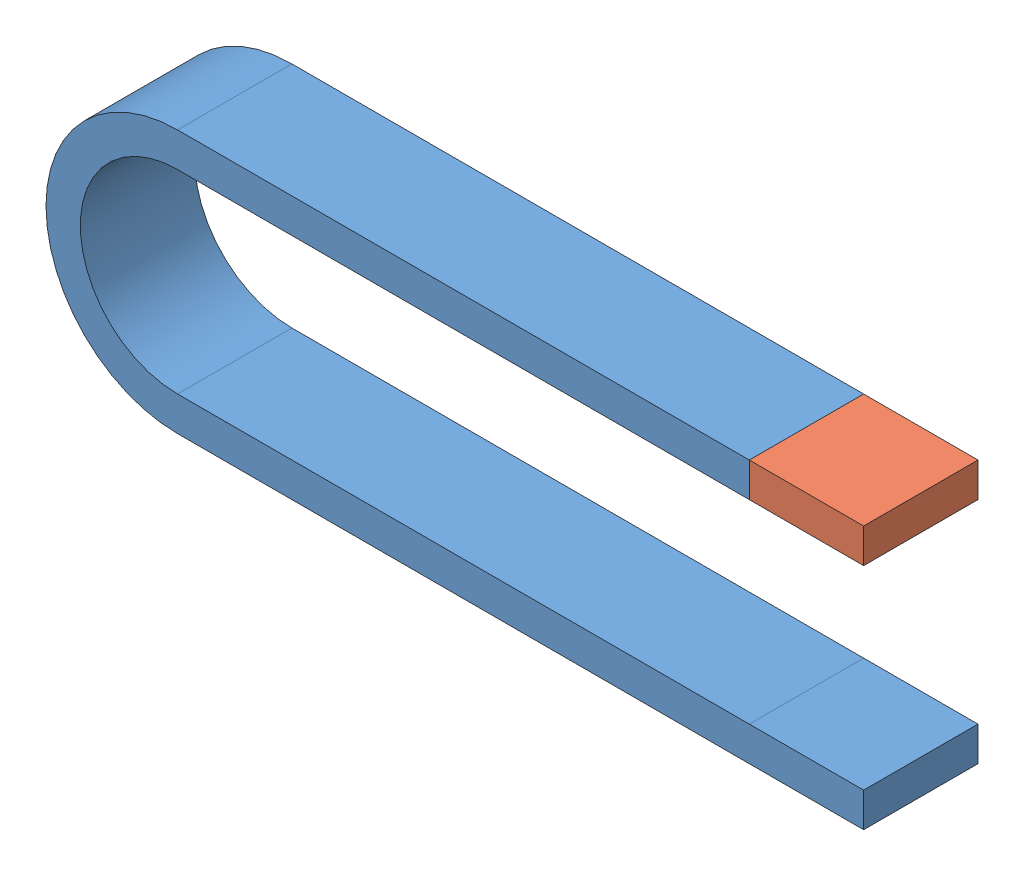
SolidWorks assembly clip.SLDASM, configuration Default (file format 3400). Lengths in mm.
Overall size (35.75 11.5 5).
2 component instances, 2 part files, 3 mates.
Components (placement in the parent):
- clip 01-1: clip 01.SLDPRT [Default] at origin size (35.75 11.5 5)
- clip 02-1: clip 02.SLDPRT [Default] at (25 6.5 0) x (0 0 -1) z (1 0 0) size (5 1.5 5)
Mates (geometry in assembly coordinates):
- Coincident3: coincident aligned: plane of clip 01-1 through (0 10.75 2.5) normal (0 1 0); plane of clip 02-1 through (30 10.75 -2.5) normal (0 1 0)
- Coincident4: coincident anti-aligned: plane of clip 01-1 through (25 10.75 2.5) normal (1 0 0); plane of clip 02-1 through (25 10.75 2.5) normal (-1 0 0)
- Coincident5: coincident aligned: plane of clip 01-1 through (0 0.75 2.5) normal (0 0 1); plane of clip 02-1 through (30 10.75 2.5) normal (0 0 1)
